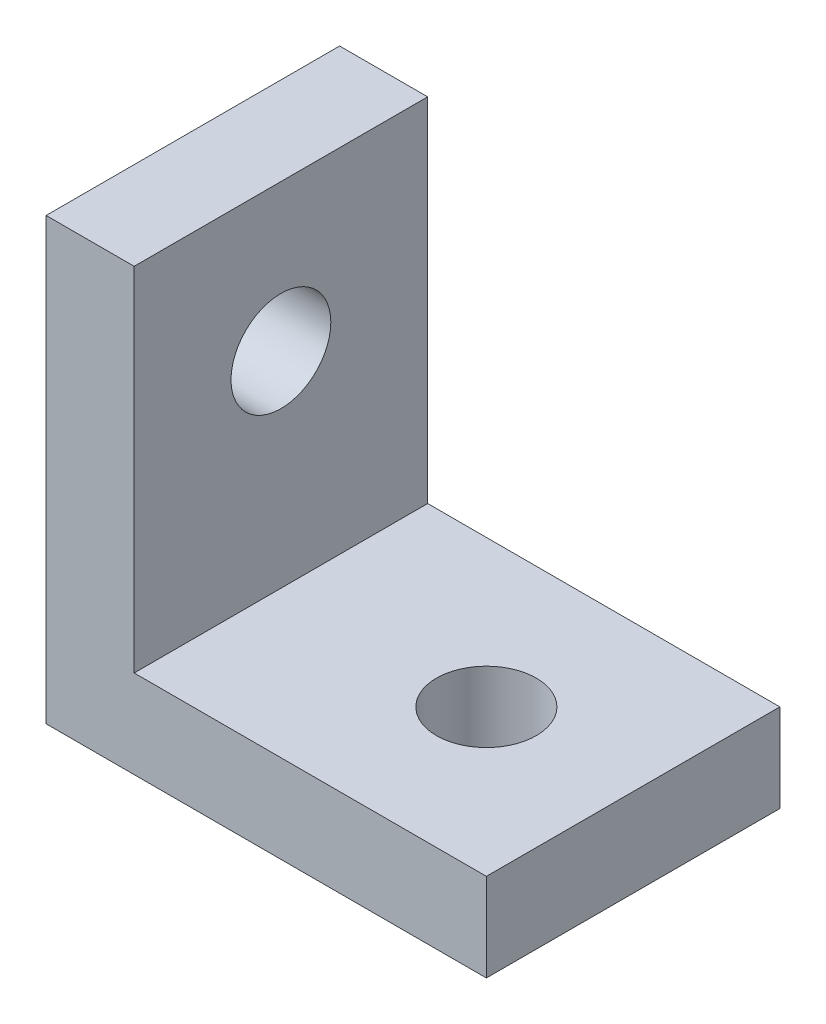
ISO-10303-21;
HEADER;
FILE_DESCRIPTION(('STEP AP214'),'2;1');
FILE_NAME('part.step','',(''),(''),'','','');
FILE_SCHEMA(('AUTOMOTIVE_DESIGN { 1 0 10303 214 1 1 1 1 }'));
ENDSEC;
DATA;
#1=APPLICATION_CONTEXT('core data for automotive mechanical design processes');
#2=APPLICATION_PROTOCOL_DEFINITION('international standard','automotive_design',2000,#1);
#3=PRODUCT_CONTEXT('',#1,'mechanical');
#4=PRODUCT('Part','Part','',(#3));
#5=PRODUCT_RELATED_PRODUCT_CATEGORY('part','',(#4));
#6=PRODUCT_DEFINITION_FORMATION('','',#4);
#7=PRODUCT_DEFINITION_CONTEXT('part definition',#1,'design');
#8=PRODUCT_DEFINITION('design','',#6,#7);
#9=PRODUCT_DEFINITION_SHAPE('','',#8);
#10=(LENGTH_UNIT() NAMED_UNIT(*) SI_UNIT(.MILLI.,.METRE.));
#11=(NAMED_UNIT(*) PLANE_ANGLE_UNIT() SI_UNIT($,.RADIAN.));
#12=(NAMED_UNIT(*) SI_UNIT($,.STERADIAN.) SOLID_ANGLE_UNIT());
#13=UNCERTAINTY_MEASURE_WITH_UNIT(LENGTH_MEASURE(1.E-05),#10,'distance_accuracy_value','');
#14=(GEOMETRIC_REPRESENTATION_CONTEXT(3) GLOBAL_UNCERTAINTY_ASSIGNED_CONTEXT((#13)) GLOBAL_UNIT_ASSIGNED_CONTEXT((#10,
#11,#12)) REPRESENTATION_CONTEXT('',''));
#15=CARTESIAN_POINT('',(0.,0.,0.));
#16=DIRECTION('',(0.,0.,1.));
#17=DIRECTION('',(1.,0.,0.));
#18=AXIS2_PLACEMENT_3D('',#15,#16,#17);
#19=CARTESIAN_POINT('',(7.5,7.5,10.));
#20=DIRECTION('',(-1.,0.,0.));
#21=DIRECTION('',(0.,-1.,0.));
#22=AXIS2_PLACEMENT_3D('',#19,#20,#21);
#23=PLANE('',#22);
#24=DIRECTION('',(0.,1.,0.));
#25=VECTOR('',#24,1.);
#26=CARTESIAN_POINT('',(7.5,7.5,0.));
#27=LINE('',#26,#25);
#28=CARTESIAN_POINT('',(7.5,-7.5,0.));
#29=VERTEX_POINT('',#28);
#30=CARTESIAN_POINT('',(7.5,-4.5,0.));
#31=VERTEX_POINT('',#30);
#32=EDGE_CURVE('E117',#29,#31,#27,.T.);
#33=ORIENTED_EDGE('',*,*,#32,.T.);
#34=DIRECTION('',(0.,0.,1.));
#35=VECTOR('',#34,1.);
#36=CARTESIAN_POINT('',(7.5,-4.5,10.));
#37=LINE('',#36,#35);
#38=CARTESIAN_POINT('',(7.5,-4.5,10.));
#39=VERTEX_POINT('',#38);
#40=EDGE_CURVE('E49',#31,#39,#37,.T.);
#41=ORIENTED_EDGE('',*,*,#40,.T.);
#42=DIRECTION('',(0.,1.,0.));
#43=VECTOR('',#42,1.);
#44=CARTESIAN_POINT('',(7.5,7.5,10.));
#45=LINE('',#44,#43);
#46=CARTESIAN_POINT('',(7.5,-7.5,10.));
#47=VERTEX_POINT('',#46);
#48=EDGE_CURVE('E125',#47,#39,#45,.T.);
#49=ORIENTED_EDGE('',*,*,#48,.F.);
#50=DIRECTION('',(0.,0.,-1.));
#51=VECTOR('',#50,1.);
#52=CARTESIAN_POINT('',(7.5,-7.5,10.));
#53=LINE('',#52,#51);
#54=EDGE_CURVE('E126',#47,#29,#53,.T.);
#55=ORIENTED_EDGE('',*,*,#54,.T.);
#56=EDGE_LOOP('',(#33,#41,#49,#55));
#57=FACE_BOUND('',#56,.T.);
#58=ADVANCED_FACE('F35',(#57),#23,.F.);
#59=CARTESIAN_POINT('',(-7.5,7.5,10.));
#60=DIRECTION('',(0.,-1.,0.));
#61=DIRECTION('',(0.,0.,-1.));
#62=AXIS2_PLACEMENT_3D('',#59,#60,#61);
#63=PLANE('',#62);
#64=DIRECTION('',(-1.,0.,0.));
#65=VECTOR('',#64,1.);
#66=CARTESIAN_POINT('',(-7.5,7.5,10.));
#67=LINE('',#66,#65);
#68=CARTESIAN_POINT('',(-4.5,7.5,10.));
#69=VERTEX_POINT('',#68);
#70=CARTESIAN_POINT('',(-7.5,7.5,10.));
#71=VERTEX_POINT('',#70);
#72=EDGE_CURVE('E80',#69,#71,#67,.T.);
#73=ORIENTED_EDGE('',*,*,#72,.F.);
#74=DIRECTION('',(0.,0.,-1.));
#75=VECTOR('',#74,1.);
#76=CARTESIAN_POINT('',(-4.5,7.5,10.));
#77=LINE('',#76,#75);
#78=CARTESIAN_POINT('',(-4.5,7.5,0.));
#79=VERTEX_POINT('',#78);
#80=EDGE_CURVE('E120',#69,#79,#77,.T.);
#81=ORIENTED_EDGE('',*,*,#80,.T.);
#82=DIRECTION('',(-1.,0.,0.));
#83=VECTOR('',#82,1.);
#84=CARTESIAN_POINT('',(-7.5,7.5,0.));
#85=LINE('',#84,#83);
#86=CARTESIAN_POINT('',(-7.5,7.5,0.));
#87=VERTEX_POINT('',#86);
#88=EDGE_CURVE('E113',#79,#87,#85,.T.);
#89=ORIENTED_EDGE('',*,*,#88,.T.);
#90=DIRECTION('',(0.,0.,-1.));
#91=VECTOR('',#90,1.);
#92=CARTESIAN_POINT('',(-7.5,7.5,10.));
#93=LINE('',#92,#91);
#94=EDGE_CURVE('E42',#71,#87,#93,.T.);
#95=ORIENTED_EDGE('',*,*,#94,.F.);
#96=EDGE_LOOP('',(#73,#81,#89,#95));
#97=FACE_BOUND('',#96,.T.);
#98=ADVANCED_FACE('F134',(#97),#63,.F.);
#99=CARTESIAN_POINT('',(-7.5,7.5,10.));
#100=DIRECTION('',(1.,0.,0.));
#101=DIRECTION('',(0.,1.,0.));
#102=AXIS2_PLACEMENT_3D('',#99,#100,#101);
#103=PLANE('',#102);
#104=CARTESIAN_POINT('',(-7.5,2.5,5.));
#105=DIRECTION('',(1.,0.,0.));
#106=DIRECTION('',(0.,0.,-1.));
#107=AXIS2_PLACEMENT_3D('',#104,#105,#106);
#108=CIRCLE('',#107,1.7);
#109=CARTESIAN_POINT('',(-7.5,2.5,3.3));
#110=VERTEX_POINT('',#109);
#111=EDGE_CURVE('E142',#110,#110,#108,.T.);
#112=ORIENTED_EDGE('',*,*,#111,.T.);
#113=EDGE_LOOP('',(#112));
#114=FACE_BOUND('',#113,.T.);
#115=DIRECTION('',(0.,-1.,0.));
#116=VECTOR('',#115,1.);
#117=CARTESIAN_POINT('',(-7.5,7.5,0.));
#118=LINE('',#117,#116);
#119=CARTESIAN_POINT('',(-7.5,-7.5,0.));
#120=VERTEX_POINT('',#119);
#121=EDGE_CURVE('E114',#87,#120,#118,.T.);
#122=ORIENTED_EDGE('',*,*,#121,.T.);
#123=DIRECTION('',(0.,0.,-1.));
#124=VECTOR('',#123,1.);
#125=CARTESIAN_POINT('',(-7.5,-7.5,10.));
#126=LINE('',#125,#124);
#127=CARTESIAN_POINT('',(-7.5,-7.5,10.));
#128=VERTEX_POINT('',#127);
#129=EDGE_CURVE('E128',#128,#120,#126,.T.);
#130=ORIENTED_EDGE('',*,*,#129,.F.);
#131=DIRECTION('',(0.,-1.,0.));
#132=VECTOR('',#131,1.);
#133=CARTESIAN_POINT('',(-7.5,7.5,10.));
#134=LINE('',#133,#132);
#135=EDGE_CURVE('E133',#71,#128,#134,.T.);
#136=ORIENTED_EDGE('',*,*,#135,.F.);
#137=ORIENTED_EDGE('',*,*,#94,.T.);
#138=EDGE_LOOP('',(#122,#130,#136,#137));
#139=FACE_BOUND('',#138,.T.);
#140=ADVANCED_FACE('F131',(#114,#139),#103,.F.);
#141=CARTESIAN_POINT('',(-7.5,-7.5,10.));
#142=DIRECTION('',(0.,1.,0.));
#143=DIRECTION('',(0.,0.,1.));
#144=AXIS2_PLACEMENT_3D('',#141,#142,#143);
#145=PLANE('',#144);
#146=CARTESIAN_POINT('',(2.5,-7.5,5.));
#147=DIRECTION('',(0.,1.,0.));
#148=DIRECTION('',(0.,0.,1.));
#149=AXIS2_PLACEMENT_3D('',#146,#147,#148);
#150=CIRCLE('',#149,1.7);
#151=CARTESIAN_POINT('',(2.5,-7.5,6.7));
#152=VERTEX_POINT('',#151);
#153=EDGE_CURVE('E149',#152,#152,#150,.T.);
#154=ORIENTED_EDGE('',*,*,#153,.T.);
#155=EDGE_LOOP('',(#154));
#156=FACE_BOUND('',#155,.T.);
#157=DIRECTION('',(1.,0.,0.));
#158=VECTOR('',#157,1.);
#159=CARTESIAN_POINT('',(-7.5,-7.5,0.));
#160=LINE('',#159,#158);
#161=EDGE_CURVE('E75',#120,#29,#160,.T.);
#162=ORIENTED_EDGE('',*,*,#161,.T.);
#163=ORIENTED_EDGE('',*,*,#54,.F.);
#164=DIRECTION('',(1.,0.,0.));
#165=VECTOR('',#164,1.);
#166=CARTESIAN_POINT('',(-7.5,-7.5,10.));
#167=LINE('',#166,#165);
#168=EDGE_CURVE('E58',#128,#47,#167,.T.);
#169=ORIENTED_EDGE('',*,*,#168,.F.);
#170=ORIENTED_EDGE('',*,*,#129,.T.);
#171=EDGE_LOOP('',(#162,#163,#169,#170));
#172=FACE_BOUND('',#171,.T.);
#173=ADVANCED_FACE('F175',(#156,#172),#145,.F.);
#174=CARTESIAN_POINT('',(0.,0.,10.));
#175=DIRECTION('',(0.,0.,1.));
#176=DIRECTION('',(1.,0.,0.));
#177=AXIS2_PLACEMENT_3D('',#174,#175,#176);
#178=PLANE('',#177);
#179=DIRECTION('',(0.,-1.,0.));
#180=VECTOR('',#179,1.);
#181=CARTESIAN_POINT('',(-4.5,19.5,10.));
#182=LINE('',#181,#180);
#183=CARTESIAN_POINT('',(-4.5,-4.5,10.));
#184=VERTEX_POINT('',#183);
#185=EDGE_CURVE('E100',#69,#184,#182,.T.);
#186=ORIENTED_EDGE('',*,*,#185,.F.);
#187=ORIENTED_EDGE('',*,*,#72,.T.);
#188=ORIENTED_EDGE('',*,*,#135,.T.);
#189=ORIENTED_EDGE('',*,*,#168,.T.);
#190=ORIENTED_EDGE('',*,*,#48,.T.);
#191=DIRECTION('',(1.,0.,0.));
#192=VECTOR('',#191,1.);
#193=CARTESIAN_POINT('',(19.5,-4.5,10.));
#194=LINE('',#193,#192);
#195=EDGE_CURVE('E108',#184,#39,#194,.T.);
#196=ORIENTED_EDGE('',*,*,#195,.F.);
#197=EDGE_LOOP('',(#186,#187,#188,#189,#190,#196));
#198=FACE_BOUND('',#197,.T.);
#199=ADVANCED_FACE('F177',(#198),#178,.T.);
#200=CARTESIAN_POINT('',(0.,0.,0.));
#201=DIRECTION('',(0.,0.,1.));
#202=DIRECTION('',(1.,0.,0.));
#203=AXIS2_PLACEMENT_3D('',#200,#201,#202);
#204=PLANE('',#203);
#205=ORIENTED_EDGE('',*,*,#88,.F.);
#206=DIRECTION('',(0.,-1.,0.));
#207=VECTOR('',#206,1.);
#208=CARTESIAN_POINT('',(-4.5,0.,0.));
#209=LINE('',#208,#207);
#210=CARTESIAN_POINT('',(-4.5,-4.5,0.));
#211=VERTEX_POINT('',#210);
#212=EDGE_CURVE('E11',#79,#211,#209,.T.);
#213=ORIENTED_EDGE('',*,*,#212,.T.);
#214=DIRECTION('',(1.,0.,0.));
#215=VECTOR('',#214,1.);
#216=CARTESIAN_POINT('',(19.5,-4.5,0.));
#217=LINE('',#216,#215);
#218=EDGE_CURVE('E102',#211,#31,#217,.T.);
#219=ORIENTED_EDGE('',*,*,#218,.T.);
#220=ORIENTED_EDGE('',*,*,#32,.F.);
#221=ORIENTED_EDGE('',*,*,#161,.F.);
#222=ORIENTED_EDGE('',*,*,#121,.F.);
#223=EDGE_LOOP('',(#205,#213,#219,#220,#221,#222));
#224=FACE_BOUND('',#223,.T.);
#225=ADVANCED_FACE('F111',(#224),#204,.F.);
#226=CARTESIAN_POINT('',(-4.5,19.5,0.));
#227=DIRECTION('',(-1.,0.,0.));
#228=DIRECTION('',(0.,0.,1.));
#229=AXIS2_PLACEMENT_3D('',#226,#227,#228);
#230=PLANE('',#229);
#231=CARTESIAN_POINT('',(-4.5,2.5,5.));
#232=DIRECTION('',(1.,0.,0.));
#233=DIRECTION('',(0.,0.,-1.));
#234=AXIS2_PLACEMENT_3D('',#231,#232,#233);
#235=CIRCLE('',#234,1.69999999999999);
#236=CARTESIAN_POINT('',(-4.5,2.5,3.30000000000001));
#237=VERTEX_POINT('',#236);
#238=EDGE_CURVE('E146',#237,#237,#235,.T.);
#239=ORIENTED_EDGE('',*,*,#238,.F.);
#240=EDGE_LOOP('',(#239));
#241=FACE_BOUND('',#240,.T.);
#242=ORIENTED_EDGE('',*,*,#185,.T.);
#243=DIRECTION('',(0.,0.,1.));
#244=VECTOR('',#243,1.);
#245=CARTESIAN_POINT('',(-4.5,-4.5,0.));
#246=LINE('',#245,#244);
#247=EDGE_CURVE('E97',#211,#184,#246,.T.);
#248=ORIENTED_EDGE('',*,*,#247,.F.);
#249=ORIENTED_EDGE('',*,*,#212,.F.);
#250=ORIENTED_EDGE('',*,*,#80,.F.);
#251=EDGE_LOOP('',(#242,#248,#249,#250));
#252=FACE_BOUND('',#251,.T.);
#253=ADVANCED_FACE('F98',(#241,#252),#230,.F.);
#254=CARTESIAN_POINT('',(19.5,-4.5,0.));
#255=DIRECTION('',(0.,-1.,0.));
#256=DIRECTION('',(0.,0.,-1.));
#257=AXIS2_PLACEMENT_3D('',#254,#255,#256);
#258=PLANE('',#257);
#259=CARTESIAN_POINT('',(2.5,-4.5,5.));
#260=DIRECTION('',(0.,1.,0.));
#261=DIRECTION('',(0.,0.,1.));
#262=AXIS2_PLACEMENT_3D('',#259,#260,#261);
#263=CIRCLE('',#262,1.69999999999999);
#264=CARTESIAN_POINT('',(2.5,-4.5,6.69999999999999));
#265=VERTEX_POINT('',#264);
#266=EDGE_CURVE('E152',#265,#265,#263,.T.);
#267=ORIENTED_EDGE('',*,*,#266,.F.);
#268=EDGE_LOOP('',(#267));
#269=FACE_BOUND('',#268,.T.);
#270=ORIENTED_EDGE('',*,*,#218,.F.);
#271=ORIENTED_EDGE('',*,*,#247,.T.);
#272=ORIENTED_EDGE('',*,*,#195,.T.);
#273=ORIENTED_EDGE('',*,*,#40,.F.);
#274=EDGE_LOOP('',(#270,#271,#272,#273));
#275=FACE_BOUND('',#274,.T.);
#276=ADVANCED_FACE('F104',(#269,#275),#258,.F.);
#277=CARTESIAN_POINT('',(-4.5,2.5,5.));
#278=DIRECTION('',(1.,0.,0.));
#279=DIRECTION('',(0.,0.,-1.));
#280=AXIS2_PLACEMENT_3D('',#277,#278,#279);
#281=CYLINDRICAL_SURFACE('',#280,1.69999999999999);
#282=ORIENTED_EDGE('',*,*,#111,.F.);
#283=EDGE_LOOP('',(#282));
#284=FACE_BOUND('',#283,.T.);
#285=ORIENTED_EDGE('',*,*,#238,.T.);
#286=EDGE_LOOP('',(#285));
#287=FACE_BOUND('',#286,.T.);
#288=ADVANCED_FACE('F159',(#284,#287),#281,.F.);
#289=CARTESIAN_POINT('',(2.5,-4.5,5.));
#290=DIRECTION('',(0.,1.,0.));
#291=DIRECTION('',(0.,0.,1.));
#292=AXIS2_PLACEMENT_3D('',#289,#290,#291);
#293=CYLINDRICAL_SURFACE('',#292,1.69999999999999);
#294=ORIENTED_EDGE('',*,*,#153,.F.);
#295=EDGE_LOOP('',(#294));
#296=FACE_BOUND('',#295,.T.);
#297=ORIENTED_EDGE('',*,*,#266,.T.);
#298=EDGE_LOOP('',(#297));
#299=FACE_BOUND('',#298,.T.);
#300=ADVANCED_FACE('F156',(#296,#299),#293,.F.);
#301=CLOSED_SHELL('',(#58,#98,#140,#173,#199,#225,#253,#276,#288,#300));
#302=MANIFOLD_SOLID_BREP('B2',#301);
#303=ADVANCED_BREP_SHAPE_REPRESENTATION('',(#18,#302),#14);
#304=SHAPE_DEFINITION_REPRESENTATION(#9,#303);
ENDSEC;
END-ISO-10303-21;
